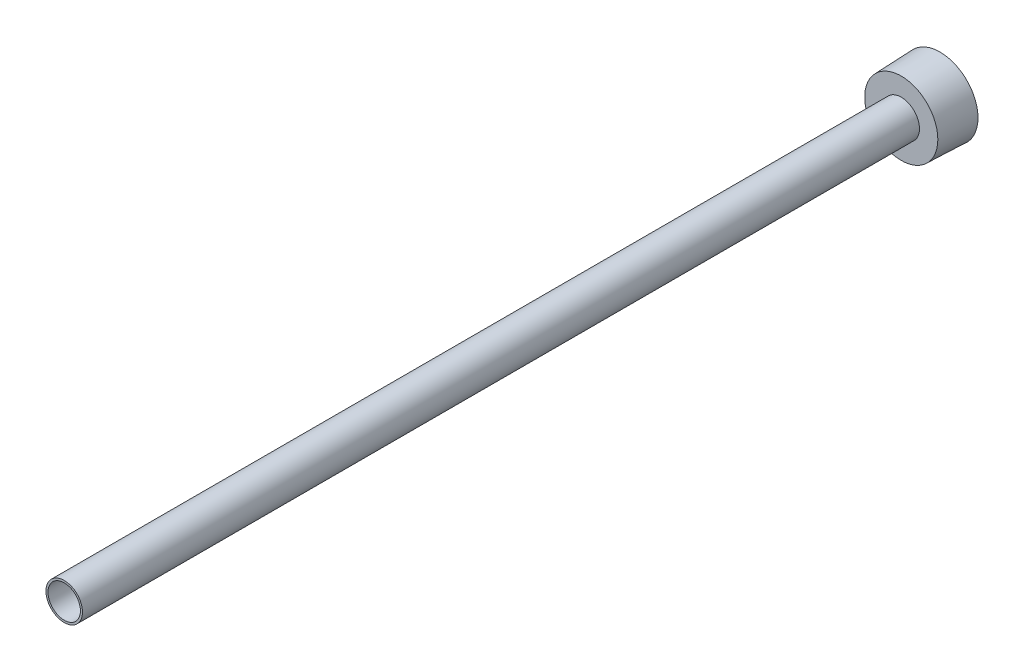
from build123d import *

# Parameters (mm, degrees)
SKETCH2_R          = 5.6388
CUT_EXTRUDE1_DEPTH = 306.372909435
CUT_EXTRUDE2_DEPTH = 9.525


with BuildPart() as part:
    # Sketch1 → Revolve1 (revolve)
    with BuildSketch(Plane(origin=(0, 0, 0), x_dir=(0, 0, -1), z_dir=(1, 0, 0)), mode=Mode.PRIVATE) as revolve1_sk:
        Polygon((-304.8, 0), (0, 0), (0, 13.2207), (-13.4874, 12.728732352), (-13.4874, 6.35), (-304.8, 6.35), align=None)
    revolve(revolve1_sk.sketch.rotate(Axis((0, 0, 278.001114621), (0, 0, -1)), 90), axis=Axis((0, 0, 278.001114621), (0, 0, -1)))

    # Sketch2 → Cut-Extrude1 (cut, through all)
    with BuildSketch(Plane.XY.offset(304.8)):
        Circle(SKETCH2_R)
    extrude(amount=-CUT_EXTRUDE1_DEPTH, mode=Mode.SUBTRACT)

    # Sketch3 → Cut-Extrude2 (cut)
    with BuildSketch(Plane(origin=(0, 0, 0), x_dir=(-1, 0, 0), z_dir=(0, 0, -1))):
        Polygon((-9.525, -5.499261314), (0, -10.998522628), (9.525, -5.499261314), (9.525, 5.499261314), (0, 10.998522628), (-9.525, 5.499261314), align=None)
    extrude(amount=-CUT_EXTRUDE2_DEPTH, mode=Mode.SUBTRACT)


solid = part.part
